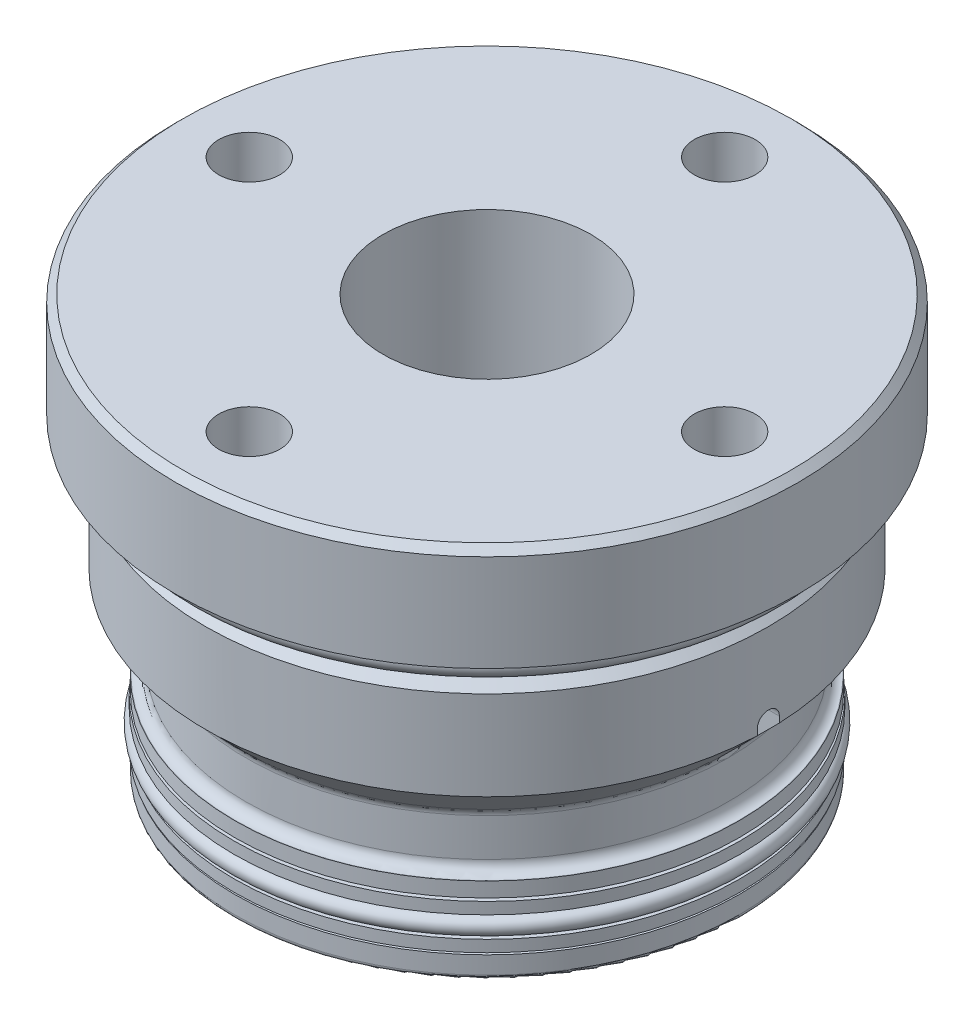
from build123d import *

# Parameters (mm, degrees)
FILLET1_R               = 1.143
FILLET2_R               = 0.381
FILLET3_R               = 0.508
CIRPATTERN1_COUNT       = 4
CHAMFER1_SIZE           = 0.762000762
FILLET4_R               = 0.381
SKETCH5_R               = 1.3081
SKETCH6_R               = 0.889
SKETCH6_W               = 1.3462
SKETCH6_H               = 1.2446
CUT_EXTRUDE1_DEPTH      = 65.731141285
CUT_EXTRUDE1_DEPTH_BACK = 65.731141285
SKETCH7_R               = 1.1811
CUT_EXTRUDE3_START      = 25.7556
CUT_EXTRUDE3_DEPTH      = 27.686


with BuildPart() as part:
    # Sketch1 → Revolve1 (revolve)
    with BuildSketch(Plane.XY, mode=Mode.PRIVATE) as revolve1_sk:
        Polygon((-22.225, 0), (-22.225, 21.4122), (-11.1125, 21.4122), (-11.1125, 44.45), (-33.274, 44.45), (-33.274, 33.3502), (-30.0863, 33.3502), (-30.0863, 19.2278), (-25.7556, 14.8971), (-25.7556, 9.2202), (-26.9494, 9.2202), (-26.9494, 7.6454), (-25.6921, 7.6454), (-25.6921, 2.3876), (-26.9494, 2.3876), (-26.9494, 0), align=None)
    revolve(revolve1_sk.sketch.rotate(Axis((0, 0, 0), (0, 1, 0)), 270), axis=Axis((0, 0, 0), (0, 1, 0)))

    # Fillet1
    fillet1_edges = [part.edges().sort_by_distance(p)[0] for p in [
        (0, 9.2202, 25.7556),
        (0, 14.8971, 25.7556),
    ]]
    fillet(fillet1_edges, radius=FILLET1_R)

    # Fillet2
    fillet2_edges = [part.edges().sort_by_distance(p)[0] for p in [
        (0, 2.3876, 25.6921),
        (0, 7.6454, 25.6921),
    ]]
    fillet(fillet2_edges, radius=FILLET2_R)

    # Fillet3
    fillet3_edges = [part.edges().sort_by_distance(p)[0] for p in [
        (0, 0, 26.9494),
    ]]
    fillet(fillet3_edges, radius=FILLET3_R)

    # Sketch2 → Hole1 (revolve, cut)
    with BuildSketch(Plane(origin=(25.4, 44.45, 0), x_dir=(0, 0, 1), z_dir=(1, 0, 0))):
        Polygon((0, 0), (0, 8.311148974), (3.2639, 6.35), (3.2639, 0), align=None)
    hole1 = revolve(axis=Axis((25.4, 48.694199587, 0), (0, -1, 0)), mode=Mode.SUBTRACT)

    # CirPattern1: Hole1 ×4 about axis
    cirpattern1_axis = Axis((0, 0, 0), (0, 1, 0))
    for i in range(1, CIRPATTERN1_COUNT):
        add(hole1.rotate(cirpattern1_axis, i * 360 / CIRPATTERN1_COUNT), mode=Mode.SUBTRACT)

    # Chamfer1
    chamfer1_edges = [part.edges().sort_by_distance(p)[0] for p in [
        (0, 44.45, 33.274),
    ]]
    chamfer(chamfer1_edges, length=CHAMFER1_SIZE)

    # Sketch4 → Cut-Revolve1 (revolve, cut)
    with BuildSketch(Plane.XY, mode=Mode.PRIVATE) as cut_revolve1_sk:
        Polygon((-30.0863, 33.3502), (-30.0863, 28.7528), (-28.9433, 29.8958), (-28.9433, 33.3502), align=None)
    revolve(cut_revolve1_sk.sketch.rotate(Axis((0, 0, 0), (0, 1, 0)), 270), axis=Axis((0, 0, 0), (0, 1, 0)), mode=Mode.SUBTRACT)

    # Fillet4
    fillet4_edges = [part.edges().sort_by_distance(p)[0] for p in [
        (0, 33.3502, 28.9433),
        (0, 29.8958, 28.9433),
    ]]
    fillet(fillet4_edges, radius=FILLET4_R)

    # Sketch5 → Revolve2 (revolve)
    with BuildSketch(Plane.XY, mode=Mode.PRIVATE) as revolve2_sk:
        with Locations((-30.2133, 32.004)):
            Circle(SKETCH5_R)
    revolve(revolve2_sk.sketch.rotate(Axis((0, 0, 0), (0, 1, 0)), 270), axis=Axis((0, 0, 0), (0, 1, 0)))

    # Sketch6 → Revolve3 (revolve)
    with BuildSketch(Plane.XY, mode=Mode.PRIVATE) as revolve3_sk:
        with Locations((-26.5303, 4.9276)):
            Circle(SKETCH6_R)
        with Locations((-26.3652, 6.7691)):
            Rectangle(SKETCH6_W, SKETCH6_H)
        with Locations((-26.3652, 3.2639)):
            Rectangle(SKETCH6_W, SKETCH6_H)
    revolve(revolve3_sk.sketch.rotate(Axis((0, 0, 0), (0, 1, 0)), 270), axis=Axis((0, 0, 0), (0, 1, 0)))

    # Sketch7 → Cut-Extrude1 (cut, two sides: drawn at the far end of the back side and taken through both)
    with BuildSketch(Plane(origin=(0, 0, 0), x_dir=(0, 0, -1), z_dir=(1, 0, 0)).offset(-CUT_EXTRUDE1_DEPTH_BACK)):
        with Locations((0, 19.8628)):
            Circle(SKETCH7_R)
    extrude(amount=CUT_EXTRUDE1_DEPTH + CUT_EXTRUDE1_DEPTH_BACK, mode=Mode.SUBTRACT)

    # Sketch8 → Cut-Extrude3 (cut)
    with BuildSketch(Plane(origin=(0, 0, 0), x_dir=(0, 0, -1), z_dir=(1, 0, 0)).offset(CUT_EXTRUDE3_START)):
        with BuildLine():
            Line((-1.1811, 19.8628), (-1.1811, 15.1003))
            ThreePointArc((-1.1811, 15.1003), (0, 13.9192), (1.1811, 15.1003))
            Line((1.1811, 15.1003), (1.1811, 19.8628))
            ThreePointArc((1.1811, 19.8628), (0, 21.0439), (-1.1811, 19.8628))
        make_face()
    cut_extrude3 = extrude(amount=CUT_EXTRUDE3_DEPTH, mode=Mode.SUBTRACT)

    # Mirror1: Cut-Extrude3 across plane
    add(cut_extrude3.mirror(Plane(origin=(0, 0, 0), x_dir=(0, 0, 1), z_dir=(1, 0, 0))), mode=Mode.SUBTRACT)


solid = part.part
